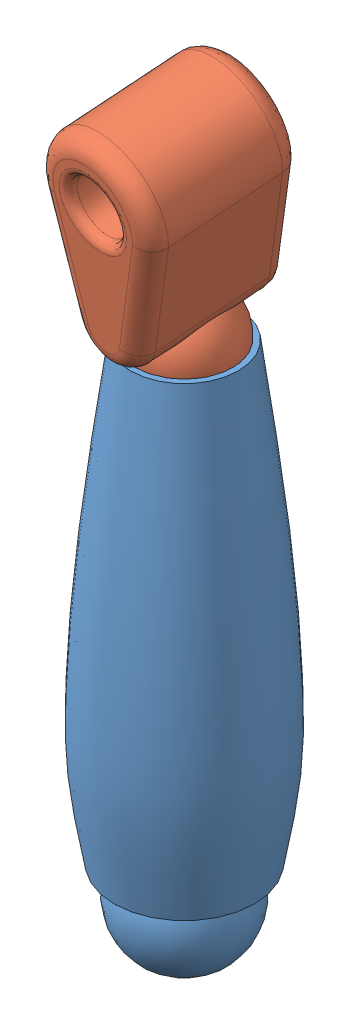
SolidWorks assembly Avant-bras et Main.SLDASM, configuration Défaut (file format 10000). Lengths in mm.
Overall size (185.54 448.47 108.44).
2 component instances, 2 part files, 1 mates.
Components (placement in the parent):
- Avant Bras-1: Avant Bras.SLDPRT [Défaut] at (-0.2482 -106.4676 0) size (95.02 300 95.02)
- Main-1: Main.SLDPRT [Défaut] at (-0.2482 147.5324 0) x (-0.705481 0.706695 0.053661) z (-0.069161 -0.143999 0.987158) size (123.72 131.34 81.13)
Mates (geometry in assembly coordinates):
- Coaxiale1: concentric: sphere of Avant Bras-1; sphere of Main-1
